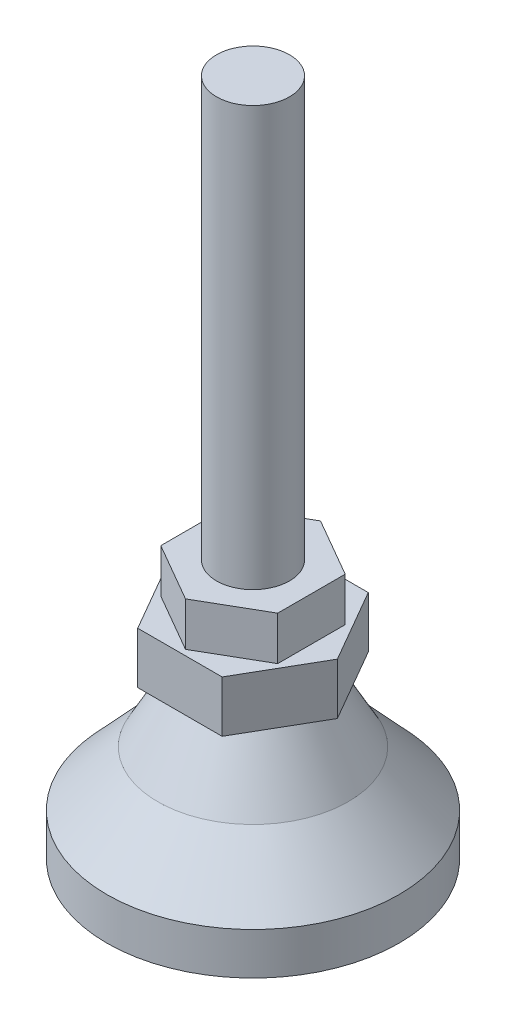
ISO-10303-21;
HEADER;
FILE_DESCRIPTION(('STEP AP214'),'2;1');
FILE_NAME('part.step','',(''),(''),'','','');
FILE_SCHEMA(('AUTOMOTIVE_DESIGN { 1 0 10303 214 1 1 1 1 }'));
ENDSEC;
DATA;
#1=APPLICATION_CONTEXT('core data for automotive mechanical design processes');
#2=APPLICATION_PROTOCOL_DEFINITION('international standard','automotive_design',2000,#1);
#3=PRODUCT_CONTEXT('',#1,'mechanical');
#4=PRODUCT('Part','Part','',(#3));
#5=PRODUCT_RELATED_PRODUCT_CATEGORY('part','',(#4));
#6=PRODUCT_DEFINITION_FORMATION('','',#4);
#7=PRODUCT_DEFINITION_CONTEXT('part definition',#1,'design');
#8=PRODUCT_DEFINITION('design','',#6,#7);
#9=PRODUCT_DEFINITION_SHAPE('','',#8);
#10=(LENGTH_UNIT() NAMED_UNIT(*) SI_UNIT(.MILLI.,.METRE.));
#11=(NAMED_UNIT(*) PLANE_ANGLE_UNIT() SI_UNIT($,.RADIAN.));
#12=(NAMED_UNIT(*) SI_UNIT($,.STERADIAN.) SOLID_ANGLE_UNIT());
#13=UNCERTAINTY_MEASURE_WITH_UNIT(LENGTH_MEASURE(1.E-05),#10,'distance_accuracy_value','');
#14=(GEOMETRIC_REPRESENTATION_CONTEXT(3) GLOBAL_UNCERTAINTY_ASSIGNED_CONTEXT((#13)) GLOBAL_UNIT_ASSIGNED_CONTEXT((#10,
#11,#12)) REPRESENTATION_CONTEXT('',''));
#15=CARTESIAN_POINT('',(0.,0.,0.));
#16=DIRECTION('',(0.,0.,1.));
#17=DIRECTION('',(1.,0.,0.));
#18=AXIS2_PLACEMENT_3D('',#15,#16,#17);
#19=CARTESIAN_POINT('',(12.7,28.1178,0.));
#20=DIRECTION('',(0.,1.,0.));
#21=DIRECTION('',(0.,0.,1.));
#22=AXIS2_PLACEMENT_3D('',#19,#20,#21);
#23=PLANE('',#22);
#24=DIRECTION('',(0.866025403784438,0.,-0.5));
#25=VECTOR('',#24,1.);
#26=CARTESIAN_POINT('',(0.,28.1178,7.33234841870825));
#27=LINE('',#26,#25);
#28=CARTESIAN_POINT('',(0.,28.1178,7.33234841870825));
#29=VERTEX_POINT('',#28);
#30=CARTESIAN_POINT('',(6.35,28.1178,3.66617420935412));
#31=VERTEX_POINT('',#30);
#32=EDGE_CURVE('E134',#29,#31,#27,.T.);
#33=ORIENTED_EDGE('',*,*,#32,.T.);
#34=DIRECTION('',(0.,0.,-1.));
#35=VECTOR('',#34,1.);
#36=CARTESIAN_POINT('',(6.35,28.1178,3.66617420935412));
#37=LINE('',#36,#35);
#38=CARTESIAN_POINT('',(6.35,28.1178,-3.66617420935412));
#39=VERTEX_POINT('',#38);
#40=EDGE_CURVE('E444',#31,#39,#37,.T.);
#41=ORIENTED_EDGE('',*,*,#40,.T.);
#42=DIRECTION('',(-0.866025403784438,0.,-0.5));
#43=VECTOR('',#42,1.);
#44=CARTESIAN_POINT('',(6.35,28.1178,-3.66617420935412));
#45=LINE('',#44,#43);
#46=CARTESIAN_POINT('',(0.,28.1178,-7.33234841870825));
#47=VERTEX_POINT('',#46);
#48=EDGE_CURVE('E446',#39,#47,#45,.T.);
#49=ORIENTED_EDGE('',*,*,#48,.T.);
#50=DIRECTION('',(-0.866025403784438,0.,0.5));
#51=VECTOR('',#50,1.);
#52=CARTESIAN_POINT('',(0.,28.1178,-7.33234841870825));
#53=LINE('',#52,#51);
#54=CARTESIAN_POINT('',(-6.35,28.1178,-3.66617420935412));
#55=VERTEX_POINT('',#54);
#56=EDGE_CURVE('E448',#47,#55,#53,.T.);
#57=ORIENTED_EDGE('',*,*,#56,.T.);
#58=DIRECTION('',(0.,0.,1.));
#59=VECTOR('',#58,1.);
#60=CARTESIAN_POINT('',(-6.35,28.1178,-3.66617420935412));
#61=LINE('',#60,#59);
#62=CARTESIAN_POINT('',(-6.35,28.1178,3.66617420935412));
#63=VERTEX_POINT('',#62);
#64=EDGE_CURVE('E143',#55,#63,#61,.T.);
#65=ORIENTED_EDGE('',*,*,#64,.T.);
#66=DIRECTION('',(0.866025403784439,0.,0.5));
#67=VECTOR('',#66,1.);
#68=CARTESIAN_POINT('',(-6.35,28.1178,3.66617420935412));
#69=LINE('',#68,#67);
#70=EDGE_CURVE('E139',#63,#29,#69,.T.);
#71=ORIENTED_EDGE('',*,*,#70,.T.);
#72=EDGE_LOOP('',(#33,#41,#49,#57,#65,#71));
#73=FACE_BOUND('',#72,.T.);
#74=CARTESIAN_POINT('',(0.,28.1178,0.));
#75=DIRECTION('',(0.,1.,0.));
#76=DIRECTION('',(0.,0.,1.));
#77=AXIS2_PLACEMENT_3D('',#74,#75,#76);
#78=CIRCLE('',#77,3.9624);
#79=CARTESIAN_POINT('',(0.,28.1178,3.9624));
#80=VERTEX_POINT('',#79);
#81=EDGE_CURVE('E432',#80,#80,#78,.T.);
#82=ORIENTED_EDGE('',*,*,#81,.F.);
#83=EDGE_LOOP('',(#82));
#84=FACE_BOUND('',#83,.T.);
#85=ADVANCED_FACE('F30',(#73,#84),#23,.T.);
#86=CARTESIAN_POINT('',(-13.748153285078,23.368,-7.9375));
#87=DIRECTION('',(0.,-1.,0.));
#88=DIRECTION('',(0.,0.,-1.));
#89=AXIS2_PLACEMENT_3D('',#86,#87,#88);
#90=PLANE('',#89);
#91=DIRECTION('',(0.5,0.,0.866025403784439));
#92=VECTOR('',#91,1.);
#93=CARTESIAN_POINT('',(-9.16543552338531,23.368,0.));
#94=LINE('',#93,#92);
#95=CARTESIAN_POINT('',(-9.16543552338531,23.368,0.));
#96=VERTEX_POINT('',#95);
#97=CARTESIAN_POINT('',(-4.58271776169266,23.368,7.9375));
#98=VERTEX_POINT('',#97);
#99=EDGE_CURVE('E170',#96,#98,#94,.T.);
#100=ORIENTED_EDGE('',*,*,#99,.T.);
#101=DIRECTION('',(1.,0.,0.));
#102=VECTOR('',#101,1.);
#103=CARTESIAN_POINT('',(-4.58271776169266,23.368,7.9375));
#104=LINE('',#103,#102);
#105=CARTESIAN_POINT('',(4.58271776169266,23.368,7.9375));
#106=VERTEX_POINT('',#105);
#107=EDGE_CURVE('E173',#98,#106,#104,.T.);
#108=ORIENTED_EDGE('',*,*,#107,.T.);
#109=DIRECTION('',(0.5,0.,-0.866025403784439));
#110=VECTOR('',#109,1.);
#111=CARTESIAN_POINT('',(4.58271776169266,23.368,7.9375));
#112=LINE('',#111,#110);
#113=CARTESIAN_POINT('',(9.16543552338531,23.368,0.));
#114=VERTEX_POINT('',#113);
#115=EDGE_CURVE('E175',#106,#114,#112,.T.);
#116=ORIENTED_EDGE('',*,*,#115,.T.);
#117=DIRECTION('',(-0.5,0.,-0.866025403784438));
#118=VECTOR('',#117,1.);
#119=CARTESIAN_POINT('',(9.16543552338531,23.368,0.));
#120=LINE('',#119,#118);
#121=CARTESIAN_POINT('',(4.58271776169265,23.368,-7.93750000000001));
#122=VERTEX_POINT('',#121);
#123=EDGE_CURVE('E177',#114,#122,#120,.T.);
#124=ORIENTED_EDGE('',*,*,#123,.T.);
#125=DIRECTION('',(-1.,0.,0.));
#126=VECTOR('',#125,1.);
#127=CARTESIAN_POINT('',(4.58271776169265,23.368,-7.93750000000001));
#128=LINE('',#127,#126);
#129=CARTESIAN_POINT('',(-4.58271776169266,23.368,-7.9375));
#130=VERTEX_POINT('',#129);
#131=EDGE_CURVE('E179',#122,#130,#128,.T.);
#132=ORIENTED_EDGE('',*,*,#131,.T.);
#133=DIRECTION('',(-0.5,0.,0.866025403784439));
#134=VECTOR('',#133,1.);
#135=CARTESIAN_POINT('',(-4.58271776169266,23.368,-7.9375));
#136=LINE('',#135,#134);
#137=EDGE_CURVE('E181',#130,#96,#136,.T.);
#138=ORIENTED_EDGE('',*,*,#137,.T.);
#139=EDGE_LOOP('',(#100,#108,#116,#124,#132,#138));
#140=FACE_BOUND('',#139,.T.);
#141=DIRECTION('',(0.866025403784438,0.,-0.5));
#142=VECTOR('',#141,1.);
#143=CARTESIAN_POINT('',(0.,23.368,7.33234841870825));
#144=LINE('',#143,#142);
#145=CARTESIAN_POINT('',(0.,23.368,7.33234841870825));
#146=VERTEX_POINT('',#145);
#147=CARTESIAN_POINT('',(6.35,23.368,3.66617420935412));
#148=VERTEX_POINT('',#147);
#149=EDGE_CURVE('E115',#146,#148,#144,.T.);
#150=ORIENTED_EDGE('',*,*,#149,.F.);
#151=DIRECTION('',(0.866025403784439,0.,0.5));
#152=VECTOR('',#151,1.);
#153=CARTESIAN_POINT('',(-6.35,23.368,3.66617420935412));
#154=LINE('',#153,#152);
#155=CARTESIAN_POINT('',(-6.35,23.368,3.66617420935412));
#156=VERTEX_POINT('',#155);
#157=EDGE_CURVE('E118',#156,#146,#154,.T.);
#158=ORIENTED_EDGE('',*,*,#157,.F.);
#159=DIRECTION('',(0.,0.,1.));
#160=VECTOR('',#159,1.);
#161=CARTESIAN_POINT('',(-6.35,23.368,-3.66617420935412));
#162=LINE('',#161,#160);
#163=CARTESIAN_POINT('',(-6.35,23.368,-3.66617420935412));
#164=VERTEX_POINT('',#163);
#165=EDGE_CURVE('E135',#164,#156,#162,.T.);
#166=ORIENTED_EDGE('',*,*,#165,.F.);
#167=DIRECTION('',(-0.866025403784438,0.,0.5));
#168=VECTOR('',#167,1.);
#169=CARTESIAN_POINT('',(0.,23.368,-7.33234841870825));
#170=LINE('',#169,#168);
#171=CARTESIAN_POINT('',(0.,23.368,-7.33234841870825));
#172=VERTEX_POINT('',#171);
#173=EDGE_CURVE('E439',#172,#164,#170,.T.);
#174=ORIENTED_EDGE('',*,*,#173,.F.);
#175=DIRECTION('',(-0.866025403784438,0.,-0.5));
#176=VECTOR('',#175,1.);
#177=CARTESIAN_POINT('',(6.35,23.368,-3.66617420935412));
#178=LINE('',#177,#176);
#179=CARTESIAN_POINT('',(6.35,23.368,-3.66617420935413));
#180=VERTEX_POINT('',#179);
#181=EDGE_CURVE('E50',#180,#172,#178,.T.);
#182=ORIENTED_EDGE('',*,*,#181,.F.);
#183=DIRECTION('',(0.,0.,-1.));
#184=VECTOR('',#183,1.);
#185=CARTESIAN_POINT('',(6.35,23.368,3.66617420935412));
#186=LINE('',#185,#184);
#187=EDGE_CURVE('E45',#148,#180,#186,.T.);
#188=ORIENTED_EDGE('',*,*,#187,.F.);
#189=EDGE_LOOP('',(#150,#158,#166,#174,#182,#188));
#190=FACE_BOUND('',#189,.T.);
#191=ADVANCED_FACE('F117',(#140,#190),#90,.F.);
#192=CARTESIAN_POINT('',(0.,0.,0.));
#193=DIRECTION('',(0.,-1.,0.));
#194=DIRECTION('',(0.,0.,-1.));
#195=AXIS2_PLACEMENT_3D('',#192,#193,#194);
#196=PLANE('',#195);
#197=CARTESIAN_POINT('',(0.,0.,0.));
#198=DIRECTION('',(0.,-1.,0.));
#199=DIRECTION('',(0.,0.,-1.));
#200=AXIS2_PLACEMENT_3D('',#197,#198,#199);
#201=CIRCLE('',#200,15.875);
#202=CARTESIAN_POINT('',(0.,0.,-15.875));
#203=VERTEX_POINT('',#202);
#204=EDGE_CURVE('E11',#203,#203,#201,.T.);
#205=ORIENTED_EDGE('',*,*,#204,.T.);
#206=EDGE_LOOP('',(#205));
#207=FACE_BOUND('',#206,.T.);
#208=ADVANCED_FACE('F32',(#207),#196,.T.);
#209=CARTESIAN_POINT('',(0.,0.,0.));
#210=DIRECTION('',(0.,-1.,0.));
#211=DIRECTION('',(0.,0.,-1.));
#212=AXIS2_PLACEMENT_3D('',#209,#210,#211);
#213=CYLINDRICAL_SURFACE('',#212,15.875);
#214=CARTESIAN_POINT('',(0.,4.572,0.));
#215=DIRECTION('',(0.,-1.,0.));
#216=DIRECTION('',(0.,0.,-1.));
#217=AXIS2_PLACEMENT_3D('',#214,#215,#216);
#218=CIRCLE('',#217,15.875);
#219=CARTESIAN_POINT('',(0.,4.572,-15.875));
#220=VERTEX_POINT('',#219);
#221=EDGE_CURVE('E38',#220,#220,#218,.T.);
#222=ORIENTED_EDGE('',*,*,#221,.T.);
#223=EDGE_LOOP('',(#222));
#224=FACE_BOUND('',#223,.T.);
#225=ORIENTED_EDGE('',*,*,#204,.F.);
#226=EDGE_LOOP('',(#225));
#227=FACE_BOUND('',#226,.T.);
#228=ADVANCED_FACE('F209',(#224,#227),#213,.T.);
#229=CARTESIAN_POINT('',(0.,4.572,0.));
#230=DIRECTION('',(0.,-1.,0.));
#231=DIRECTION('',(0.,0.,-1.));
#232=AXIS2_PLACEMENT_3D('',#229,#230,#231);
#233=CONICAL_SURFACE('',#232,15.875,0.746743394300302);
#234=CARTESIAN_POINT('',(0.,10.541,0.));
#235=DIRECTION('',(0.,-1.,0.));
#236=DIRECTION('',(0.,0.,-1.));
#237=AXIS2_PLACEMENT_3D('',#234,#235,#236);
#238=CIRCLE('',#237,10.3505);
#239=CARTESIAN_POINT('',(0.,10.541,-10.3505));
#240=VERTEX_POINT('',#239);
#241=EDGE_CURVE('E204',#240,#240,#238,.T.);
#242=ORIENTED_EDGE('',*,*,#241,.T.);
#243=EDGE_LOOP('',(#242));
#244=FACE_BOUND('',#243,.T.);
#245=ORIENTED_EDGE('',*,*,#221,.F.);
#246=EDGE_LOOP('',(#245));
#247=FACE_BOUND('',#246,.T.);
#248=ADVANCED_FACE('F212',(#244,#247),#233,.T.);
#249=CARTESIAN_POINT('',(0.,10.541,0.));
#250=DIRECTION('',(0.,-1.,0.));
#251=DIRECTION('',(0.,0.,-1.));
#252=AXIS2_PLACEMENT_3D('',#249,#250,#251);
#253=CONICAL_SURFACE('',#252,10.3505,0.504861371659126);
#254=CARTESIAN_POINT('',(0.,17.78,0.));
#255=DIRECTION('',(0.,-1.,0.));
#256=DIRECTION('',(0.,0.,-1.));
#257=AXIS2_PLACEMENT_3D('',#254,#255,#256);
#258=CIRCLE('',#257,6.35);
#259=CARTESIAN_POINT('',(0.,17.78,-6.35));
#260=VERTEX_POINT('',#259);
#261=EDGE_CURVE('E201',#260,#260,#258,.F.);
#262=ORIENTED_EDGE('',*,*,#261,.F.);
#263=EDGE_LOOP('',(#262));
#264=FACE_BOUND('',#263,.T.);
#265=ORIENTED_EDGE('',*,*,#241,.F.);
#266=EDGE_LOOP('',(#265));
#267=FACE_BOUND('',#266,.T.);
#268=ADVANCED_FACE('F214',(#264,#267),#253,.T.);
#269=CARTESIAN_POINT('',(-9.16543552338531,23.368,0.));
#270=DIRECTION('',(0.866025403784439,0.,-0.5));
#271=DIRECTION('',(-0.5,0.,-0.866025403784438));
#272=AXIS2_PLACEMENT_3D('',#269,#270,#271);
#273=PLANE('',#272);
#274=DIRECTION('',(0.5,0.,0.866025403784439));
#275=VECTOR('',#274,1.);
#276=CARTESIAN_POINT('',(-9.16543552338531,17.78,0.));
#277=LINE('',#276,#275);
#278=CARTESIAN_POINT('',(-9.16543552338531,17.78,0.));
#279=VERTEX_POINT('',#278);
#280=CARTESIAN_POINT('',(-4.58271776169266,17.78,7.9375));
#281=VERTEX_POINT('',#280);
#282=EDGE_CURVE('E157',#279,#281,#277,.T.);
#283=ORIENTED_EDGE('',*,*,#282,.T.);
#284=DIRECTION('',(0.,-1.,0.));
#285=VECTOR('',#284,1.);
#286=CARTESIAN_POINT('',(-4.58271776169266,23.368,7.9375));
#287=LINE('',#286,#285);
#288=EDGE_CURVE('E198',#98,#281,#287,.T.);
#289=ORIENTED_EDGE('',*,*,#288,.F.);
#290=ORIENTED_EDGE('',*,*,#99,.F.);
#291=DIRECTION('',(0.,-1.,0.));
#292=VECTOR('',#291,1.);
#293=CARTESIAN_POINT('',(-9.16543552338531,23.368,0.));
#294=LINE('',#293,#292);
#295=EDGE_CURVE('E183',#96,#279,#294,.T.);
#296=ORIENTED_EDGE('',*,*,#295,.T.);
#297=EDGE_LOOP('',(#283,#289,#290,#296));
#298=FACE_BOUND('',#297,.T.);
#299=ADVANCED_FACE('F221',(#298),#273,.F.);
#300=CARTESIAN_POINT('',(-4.58271776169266,23.368,7.9375));
#301=DIRECTION('',(0.,0.,-1.));
#302=DIRECTION('',(-1.,0.,0.));
#303=AXIS2_PLACEMENT_3D('',#300,#301,#302);
#304=PLANE('',#303);
#305=DIRECTION('',(1.,0.,0.));
#306=VECTOR('',#305,1.);
#307=CARTESIAN_POINT('',(-4.58271776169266,17.78,7.9375));
#308=LINE('',#307,#306);
#309=CARTESIAN_POINT('',(4.58271776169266,17.78,7.9375));
#310=VERTEX_POINT('',#309);
#311=EDGE_CURVE('E160',#281,#310,#308,.T.);
#312=ORIENTED_EDGE('',*,*,#311,.T.);
#313=DIRECTION('',(0.,-1.,0.));
#314=VECTOR('',#313,1.);
#315=CARTESIAN_POINT('',(4.58271776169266,23.368,7.9375));
#316=LINE('',#315,#314);
#317=EDGE_CURVE('E195',#106,#310,#316,.T.);
#318=ORIENTED_EDGE('',*,*,#317,.F.);
#319=ORIENTED_EDGE('',*,*,#107,.F.);
#320=ORIENTED_EDGE('',*,*,#288,.T.);
#321=EDGE_LOOP('',(#312,#318,#319,#320));
#322=FACE_BOUND('',#321,.T.);
#323=ADVANCED_FACE('F276',(#322),#304,.F.);
#324=CARTESIAN_POINT('',(4.58271776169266,23.368,7.9375));
#325=DIRECTION('',(-0.866025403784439,0.,-0.5));
#326=DIRECTION('',(-0.5,0.,0.866025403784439));
#327=AXIS2_PLACEMENT_3D('',#324,#325,#326);
#328=PLANE('',#327);
#329=DIRECTION('',(0.5,0.,-0.866025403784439));
#330=VECTOR('',#329,1.);
#331=CARTESIAN_POINT('',(4.58271776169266,17.78,7.9375));
#332=LINE('',#331,#330);
#333=CARTESIAN_POINT('',(9.16543552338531,17.78,0.));
#334=VERTEX_POINT('',#333);
#335=EDGE_CURVE('E162',#310,#334,#332,.T.);
#336=ORIENTED_EDGE('',*,*,#335,.T.);
#337=DIRECTION('',(0.,-1.,0.));
#338=VECTOR('',#337,1.);
#339=CARTESIAN_POINT('',(9.16543552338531,23.368,0.));
#340=LINE('',#339,#338);
#341=EDGE_CURVE('E192',#114,#334,#340,.T.);
#342=ORIENTED_EDGE('',*,*,#341,.F.);
#343=ORIENTED_EDGE('',*,*,#115,.F.);
#344=ORIENTED_EDGE('',*,*,#317,.T.);
#345=EDGE_LOOP('',(#336,#342,#343,#344));
#346=FACE_BOUND('',#345,.T.);
#347=ADVANCED_FACE('F272',(#346),#328,.F.);
#348=CARTESIAN_POINT('',(9.16543552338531,23.368,0.));
#349=DIRECTION('',(-0.866025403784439,0.,0.5));
#350=DIRECTION('',(0.5,0.,0.866025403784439));
#351=AXIS2_PLACEMENT_3D('',#348,#349,#350);
#352=PLANE('',#351);
#353=DIRECTION('',(-0.5,0.,-0.866025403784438));
#354=VECTOR('',#353,1.);
#355=CARTESIAN_POINT('',(9.16543552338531,17.78,0.));
#356=LINE('',#355,#354);
#357=CARTESIAN_POINT('',(4.58271776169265,17.78,-7.93750000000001));
#358=VERTEX_POINT('',#357);
#359=EDGE_CURVE('E164',#334,#358,#356,.T.);
#360=ORIENTED_EDGE('',*,*,#359,.T.);
#361=DIRECTION('',(0.,-1.,0.));
#362=VECTOR('',#361,1.);
#363=CARTESIAN_POINT('',(4.58271776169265,23.368,-7.93750000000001));
#364=LINE('',#363,#362);
#365=EDGE_CURVE('E189',#122,#358,#364,.T.);
#366=ORIENTED_EDGE('',*,*,#365,.F.);
#367=ORIENTED_EDGE('',*,*,#123,.F.);
#368=ORIENTED_EDGE('',*,*,#341,.T.);
#369=EDGE_LOOP('',(#360,#366,#367,#368));
#370=FACE_BOUND('',#369,.T.);
#371=ADVANCED_FACE('F268',(#370),#352,.F.);
#372=CARTESIAN_POINT('',(4.58271776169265,23.368,-7.93750000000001));
#373=DIRECTION('',(0.,0.,1.));
#374=DIRECTION('',(1.,0.,0.));
#375=AXIS2_PLACEMENT_3D('',#372,#373,#374);
#376=PLANE('',#375);
#377=DIRECTION('',(-1.,0.,0.));
#378=VECTOR('',#377,1.);
#379=CARTESIAN_POINT('',(4.58271776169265,17.78,-7.93750000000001));
#380=LINE('',#379,#378);
#381=CARTESIAN_POINT('',(-4.58271776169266,17.78,-7.9375));
#382=VERTEX_POINT('',#381);
#383=EDGE_CURVE('E166',#358,#382,#380,.T.);
#384=ORIENTED_EDGE('',*,*,#383,.T.);
#385=DIRECTION('',(0.,-1.,0.));
#386=VECTOR('',#385,1.);
#387=CARTESIAN_POINT('',(-4.58271776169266,23.368,-7.9375));
#388=LINE('',#387,#386);
#389=EDGE_CURVE('E186',#130,#382,#388,.T.);
#390=ORIENTED_EDGE('',*,*,#389,.F.);
#391=ORIENTED_EDGE('',*,*,#131,.F.);
#392=ORIENTED_EDGE('',*,*,#365,.T.);
#393=EDGE_LOOP('',(#384,#390,#391,#392));
#394=FACE_BOUND('',#393,.T.);
#395=ADVANCED_FACE('F264',(#394),#376,.F.);
#396=CARTESIAN_POINT('',(-4.58271776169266,23.368,-7.9375));
#397=DIRECTION('',(0.866025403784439,0.,0.5));
#398=DIRECTION('',(0.5,0.,-0.866025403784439));
#399=AXIS2_PLACEMENT_3D('',#396,#397,#398);
#400=PLANE('',#399);
#401=DIRECTION('',(-0.5,0.,0.866025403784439));
#402=VECTOR('',#401,1.);
#403=CARTESIAN_POINT('',(-4.58271776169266,17.78,-7.9375));
#404=LINE('',#403,#402);
#405=EDGE_CURVE('E168',#382,#279,#404,.T.);
#406=ORIENTED_EDGE('',*,*,#405,.T.);
#407=ORIENTED_EDGE('',*,*,#295,.F.);
#408=ORIENTED_EDGE('',*,*,#137,.F.);
#409=ORIENTED_EDGE('',*,*,#389,.T.);
#410=EDGE_LOOP('',(#406,#407,#408,#409));
#411=FACE_BOUND('',#410,.T.);
#412=ADVANCED_FACE('F259',(#411),#400,.F.);
#413=CARTESIAN_POINT('',(-13.748153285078,17.78,-7.9375));
#414=DIRECTION('',(0.,-1.,0.));
#415=DIRECTION('',(0.,0.,-1.));
#416=AXIS2_PLACEMENT_3D('',#413,#414,#415);
#417=PLANE('',#416);
#418=ORIENTED_EDGE('',*,*,#261,.T.);
#419=EDGE_LOOP('',(#418));
#420=FACE_BOUND('',#419,.T.);
#421=ORIENTED_EDGE('',*,*,#282,.F.);
#422=ORIENTED_EDGE('',*,*,#405,.F.);
#423=ORIENTED_EDGE('',*,*,#383,.F.);
#424=ORIENTED_EDGE('',*,*,#359,.F.);
#425=ORIENTED_EDGE('',*,*,#335,.F.);
#426=ORIENTED_EDGE('',*,*,#311,.F.);
#427=EDGE_LOOP('',(#421,#422,#423,#424,#425,#426));
#428=FACE_BOUND('',#427,.T.);
#429=ADVANCED_FACE('F257',(#420,#428),#417,.T.);
#430=CARTESIAN_POINT('',(0.,28.1178,7.33234841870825));
#431=DIRECTION('',(-0.5,0.,-0.866025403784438));
#432=DIRECTION('',(-0.866025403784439,0.,0.5));
#433=AXIS2_PLACEMENT_3D('',#430,#431,#432);
#434=PLANE('',#433);
#435=ORIENTED_EDGE('',*,*,#149,.T.);
#436=DIRECTION('',(0.,-1.,0.));
#437=VECTOR('',#436,1.);
#438=CARTESIAN_POINT('',(6.35,28.1178,3.66617420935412));
#439=LINE('',#438,#437);
#440=EDGE_CURVE('E155',#31,#148,#439,.T.);
#441=ORIENTED_EDGE('',*,*,#440,.F.);
#442=ORIENTED_EDGE('',*,*,#32,.F.);
#443=DIRECTION('',(0.,-1.,0.));
#444=VECTOR('',#443,1.);
#445=CARTESIAN_POINT('',(0.,28.1178,7.33234841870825));
#446=LINE('',#445,#444);
#447=EDGE_CURVE('E130',#29,#146,#446,.T.);
#448=ORIENTED_EDGE('',*,*,#447,.T.);
#449=EDGE_LOOP('',(#435,#441,#442,#448));
#450=FACE_BOUND('',#449,.T.);
#451=ADVANCED_FACE('F137',(#450),#434,.F.);
#452=CARTESIAN_POINT('',(6.35,28.1178,3.66617420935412));
#453=DIRECTION('',(-1.,0.,0.));
#454=DIRECTION('',(0.,0.,1.));
#455=AXIS2_PLACEMENT_3D('',#452,#453,#454);
#456=PLANE('',#455);
#457=ORIENTED_EDGE('',*,*,#187,.T.);
#458=DIRECTION('',(0.,-1.,0.));
#459=VECTOR('',#458,1.);
#460=CARTESIAN_POINT('',(6.35,28.1178,-3.66617420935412));
#461=LINE('',#460,#459);
#462=EDGE_CURVE('E152',#39,#180,#461,.T.);
#463=ORIENTED_EDGE('',*,*,#462,.F.);
#464=ORIENTED_EDGE('',*,*,#40,.F.);
#465=ORIENTED_EDGE('',*,*,#440,.T.);
#466=EDGE_LOOP('',(#457,#463,#464,#465));
#467=FACE_BOUND('',#466,.T.);
#468=ADVANCED_FACE('F250',(#467),#456,.F.);
#469=CARTESIAN_POINT('',(6.35,28.1178,-3.66617420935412));
#470=DIRECTION('',(-0.5,0.,0.866025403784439));
#471=DIRECTION('',(0.866025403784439,0.,0.5));
#472=AXIS2_PLACEMENT_3D('',#469,#470,#471);
#473=PLANE('',#472);
#474=ORIENTED_EDGE('',*,*,#181,.T.);
#475=DIRECTION('',(0.,-1.,0.));
#476=VECTOR('',#475,1.);
#477=CARTESIAN_POINT('',(0.,28.1178,-7.33234841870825));
#478=LINE('',#477,#476);
#479=EDGE_CURVE('E149',#47,#172,#478,.T.);
#480=ORIENTED_EDGE('',*,*,#479,.F.);
#481=ORIENTED_EDGE('',*,*,#48,.F.);
#482=ORIENTED_EDGE('',*,*,#462,.T.);
#483=EDGE_LOOP('',(#474,#480,#481,#482));
#484=FACE_BOUND('',#483,.T.);
#485=ADVANCED_FACE('F246',(#484),#473,.F.);
#486=CARTESIAN_POINT('',(0.,28.1178,-7.33234841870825));
#487=DIRECTION('',(0.5,0.,0.866025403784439));
#488=DIRECTION('',(0.866025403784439,0.,-0.5));
#489=AXIS2_PLACEMENT_3D('',#486,#487,#488);
#490=PLANE('',#489);
#491=ORIENTED_EDGE('',*,*,#173,.T.);
#492=DIRECTION('',(0.,-1.,0.));
#493=VECTOR('',#492,1.);
#494=CARTESIAN_POINT('',(-6.35,28.1178,-3.66617420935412));
#495=LINE('',#494,#493);
#496=EDGE_CURVE('E141',#55,#164,#495,.T.);
#497=ORIENTED_EDGE('',*,*,#496,.F.);
#498=ORIENTED_EDGE('',*,*,#56,.F.);
#499=ORIENTED_EDGE('',*,*,#479,.T.);
#500=EDGE_LOOP('',(#491,#497,#498,#499));
#501=FACE_BOUND('',#500,.T.);
#502=ADVANCED_FACE('F242',(#501),#490,.F.);
#503=CARTESIAN_POINT('',(-6.35,28.1178,-3.66617420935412));
#504=DIRECTION('',(1.,0.,0.));
#505=DIRECTION('',(0.,0.,-1.));
#506=AXIS2_PLACEMENT_3D('',#503,#504,#505);
#507=PLANE('',#506);
#508=ORIENTED_EDGE('',*,*,#165,.T.);
#509=DIRECTION('',(0.,-1.,0.));
#510=VECTOR('',#509,1.);
#511=CARTESIAN_POINT('',(-6.35,28.1178,3.66617420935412));
#512=LINE('',#511,#510);
#513=EDGE_CURVE('E133',#63,#156,#512,.T.);
#514=ORIENTED_EDGE('',*,*,#513,.F.);
#515=ORIENTED_EDGE('',*,*,#64,.F.);
#516=ORIENTED_EDGE('',*,*,#496,.T.);
#517=EDGE_LOOP('',(#508,#514,#515,#516));
#518=FACE_BOUND('',#517,.T.);
#519=ADVANCED_FACE('F239',(#518),#507,.F.);
#520=CARTESIAN_POINT('',(-6.35,28.1178,3.66617420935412));
#521=DIRECTION('',(0.5,0.,-0.866025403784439));
#522=DIRECTION('',(-0.866025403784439,0.,-0.5));
#523=AXIS2_PLACEMENT_3D('',#520,#521,#522);
#524=PLANE('',#523);
#525=ORIENTED_EDGE('',*,*,#157,.T.);
#526=ORIENTED_EDGE('',*,*,#447,.F.);
#527=ORIENTED_EDGE('',*,*,#70,.F.);
#528=ORIENTED_EDGE('',*,*,#513,.T.);
#529=EDGE_LOOP('',(#525,#526,#527,#528));
#530=FACE_BOUND('',#529,.T.);
#531=ADVANCED_FACE('F128',(#530),#524,.F.);
#532=CARTESIAN_POINT('',(0.,73.66,0.));
#533=DIRECTION('',(0.,-1.,0.));
#534=DIRECTION('',(0.,0.,-1.));
#535=AXIS2_PLACEMENT_3D('',#532,#533,#534);
#536=CYLINDRICAL_SURFACE('',#535,3.9624);
#537=CARTESIAN_POINT('',(0.,73.66,0.));
#538=DIRECTION('',(0.,1.,0.));
#539=DIRECTION('',(0.,0.,1.));
#540=AXIS2_PLACEMENT_3D('',#537,#538,#539);
#541=CIRCLE('',#540,3.9624);
#542=CARTESIAN_POINT('',(0.,73.66,3.9624));
#543=VERTEX_POINT('',#542);
#544=EDGE_CURVE('E123',#543,#543,#541,.T.);
#545=ORIENTED_EDGE('',*,*,#544,.F.);
#546=EDGE_LOOP('',(#545));
#547=FACE_BOUND('',#546,.T.);
#548=ORIENTED_EDGE('',*,*,#81,.T.);
#549=EDGE_LOOP('',(#548));
#550=FACE_BOUND('',#549,.T.);
#551=ADVANCED_FACE('F235',(#547,#550),#536,.T.);
#552=CARTESIAN_POINT('',(0.,73.66,0.));
#553=DIRECTION('',(0.,1.,0.));
#554=DIRECTION('',(0.,0.,1.));
#555=AXIS2_PLACEMENT_3D('',#552,#553,#554);
#556=PLANE('',#555);
#557=ORIENTED_EDGE('',*,*,#544,.T.);
#558=EDGE_LOOP('',(#557));
#559=FACE_BOUND('',#558,.T.);
#560=ADVANCED_FACE('F359',(#559),#556,.T.);
#561=CLOSED_SHELL('',(#85,#191,#208,#228,#248,#268,#299,#323,#347,#371,#395,#412,#429,#451,#468,
#485,#502,#519,#531,#551,#560));
#562=MANIFOLD_SOLID_BREP('B2',#561);
#563=ADVANCED_BREP_SHAPE_REPRESENTATION('',(#18,#562),#14);
#564=SHAPE_DEFINITION_REPRESENTATION(#9,#563);
ENDSEC;
END-ISO-10303-21;
